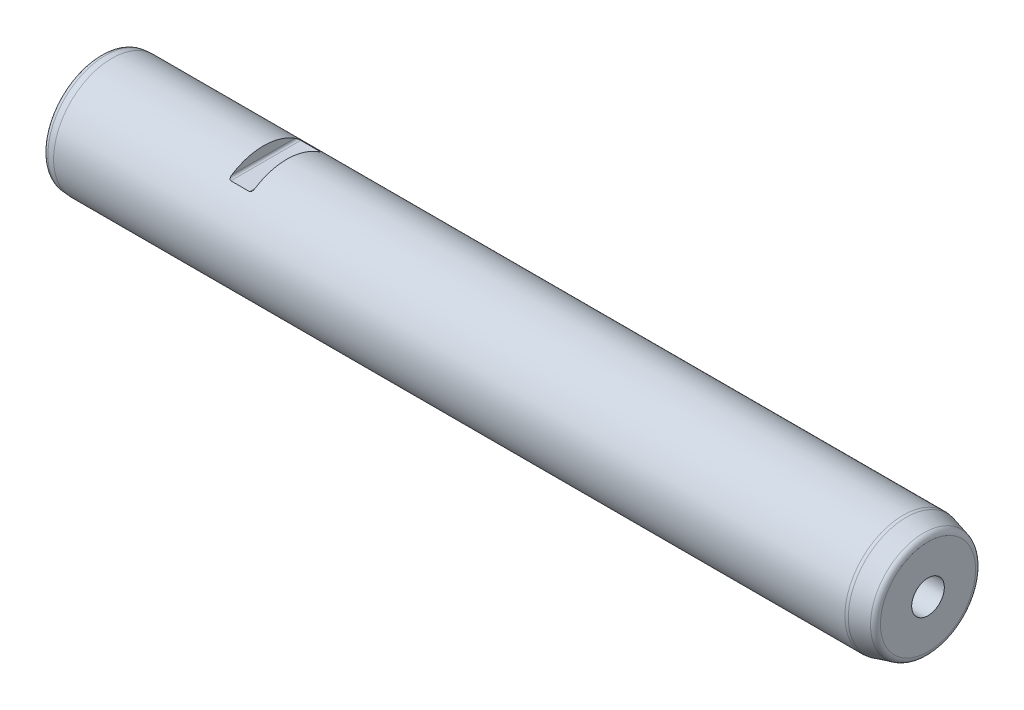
ISO-10303-21;
HEADER;
FILE_DESCRIPTION(('STEP AP214'),'2;1');
FILE_NAME('part.step','',(''),(''),'','','');
FILE_SCHEMA(('AUTOMOTIVE_DESIGN { 1 0 10303 214 1 1 1 1 }'));
ENDSEC;
DATA;
#1=APPLICATION_CONTEXT('core data for automotive mechanical design processes');
#2=APPLICATION_PROTOCOL_DEFINITION('international standard','automotive_design',2000,#1);
#3=PRODUCT_CONTEXT('',#1,'mechanical');
#4=PRODUCT('Part','Part','',(#3));
#5=PRODUCT_RELATED_PRODUCT_CATEGORY('part','',(#4));
#6=PRODUCT_DEFINITION_FORMATION('','',#4);
#7=PRODUCT_DEFINITION_CONTEXT('part definition',#1,'design');
#8=PRODUCT_DEFINITION('design','',#6,#7);
#9=PRODUCT_DEFINITION_SHAPE('','',#8);
#10=(LENGTH_UNIT() NAMED_UNIT(*) SI_UNIT(.MILLI.,.METRE.));
#11=(NAMED_UNIT(*) PLANE_ANGLE_UNIT() SI_UNIT($,.RADIAN.));
#12=(NAMED_UNIT(*) SI_UNIT($,.STERADIAN.) SOLID_ANGLE_UNIT());
#13=UNCERTAINTY_MEASURE_WITH_UNIT(LENGTH_MEASURE(1.E-05),#10,'distance_accuracy_value','');
#14=(GEOMETRIC_REPRESENTATION_CONTEXT(3) GLOBAL_UNCERTAINTY_ASSIGNED_CONTEXT((#13)) GLOBAL_UNIT_ASSIGNED_CONTEXT((#10,
#11,#12)) REPRESENTATION_CONTEXT('',''));
#15=CARTESIAN_POINT('',(0.,0.,0.));
#16=DIRECTION('',(0.,0.,1.));
#17=DIRECTION('',(1.,0.,0.));
#18=AXIS2_PLACEMENT_3D('',#15,#16,#17);
#19=CARTESIAN_POINT('',(0.,0.,0.));
#20=DIRECTION('',(1.,0.,0.));
#21=DIRECTION('',(0.,0.,-1.));
#22=AXIS2_PLACEMENT_3D('',#19,#20,#21);
#23=PLANE('',#22);
#24=CARTESIAN_POINT('',(0.,0.,0.));
#25=DIRECTION('',(1.,0.,0.));
#26=DIRECTION('',(0.,0.,-1.));
#27=AXIS2_PLACEMENT_3D('',#24,#25,#26);
#28=CIRCLE('',#27,22.2717287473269);
#29=CARTESIAN_POINT('',(0.,0.,-22.2717287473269));
#30=VERTEX_POINT('',#29);
#31=EDGE_CURVE('E160',#30,#30,#28,.F.);
#32=ORIENTED_EDGE('',*,*,#31,.T.);
#33=EDGE_LOOP('',(#32));
#34=FACE_BOUND('',#33,.T.);
#35=ADVANCED_FACE('F15',(#34),#23,.F.);
#36=CARTESIAN_POINT('',(0.,0.,0.));
#37=DIRECTION('',(-1.,0.,0.));
#38=DIRECTION('',(0.,0.,1.));
#39=AXIS2_PLACEMENT_3D('',#36,#37,#38);
#40=CYLINDRICAL_SURFACE('',#39,25.);
#41=CARTESIAN_POINT('',(79.,20.,-15.));
#42=CARTESIAN_POINT('',(79.0204326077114,19.9999962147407,-15.0000046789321));
#43=CARTESIAN_POINT('',(79.0408503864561,20.0006268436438,-14.99916423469));
#44=CARTESIAN_POINT('',(79.0814530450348,20.0031161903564,-14.9958444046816));
#45=CARTESIAN_POINT('',(79.1016381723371,20.0049734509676,-14.993366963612));
#46=CARTESIAN_POINT('',(79.1611193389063,20.0122659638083,-14.9836336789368));
#47=CARTESIAN_POINT('',(79.1998541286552,20.0194241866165,-14.9740740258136));
#48=CARTESIAN_POINT('',(79.274391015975,20.0376163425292,-14.9497209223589));
#49=CARTESIAN_POINT('',(79.3102051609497,20.048633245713,-14.9349504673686));
#50=CARTESIAN_POINT('',(79.3786965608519,20.0737580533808,-14.9011638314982));
#51=CARTESIAN_POINT('',(79.411363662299,20.0878755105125,-14.8821345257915));
#52=CARTESIAN_POINT('',(79.4896711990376,20.1264955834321,-14.8298921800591));
#53=CARTESIAN_POINT('',(79.5330744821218,20.1525500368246,-14.7944897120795));
#54=CARTESIAN_POINT('',(79.612543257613,20.2080720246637,-14.7185614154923));
#55=CARTESIAN_POINT('',(79.6485941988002,20.2375461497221,-14.6780256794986));
#56=CARTESIAN_POINT('',(79.707944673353,20.2928022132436,-14.6015056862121));
#57=CARTESIAN_POINT('',(79.7323659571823,20.3182250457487,-14.5661150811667));
#58=CARTESIAN_POINT('',(79.7773623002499,20.3700125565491,-14.4936048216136));
#59=CARTESIAN_POINT('',(79.7979348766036,20.3963778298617,-14.4564840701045));
#60=CARTESIAN_POINT('',(79.8545876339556,20.4765627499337,-14.3429056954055));
#61=CARTESIAN_POINT('',(79.8854357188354,20.5313064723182,-14.2644598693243));
#62=CARTESIAN_POINT('',(79.9262160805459,20.6210933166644,-14.1341533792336));
#63=CARTESIAN_POINT('',(79.939665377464,20.655945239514,-14.0831742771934));
#64=CARTESIAN_POINT('',(79.9623501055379,20.7257206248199,-13.9802847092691));
#65=CARTESIAN_POINT('',(79.9715835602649,20.7606441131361,-13.9283738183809));
#66=CARTESIAN_POINT('',(79.986039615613,20.829829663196,-13.8246889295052));
#67=CARTESIAN_POINT('',(79.9913190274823,20.8640939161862,-13.7729240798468));
#68=CARTESIAN_POINT('',(79.9982907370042,20.9323059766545,-13.6690320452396));
#69=CARTESIAN_POINT('',(79.9999872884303,20.9662541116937,-13.6169053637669));
#70=CARTESIAN_POINT('',(80.,21.,-13.5646599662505));
#71=B_SPLINE_CURVE_WITH_KNOTS('',3,(#41,#42,#43,#44,#45,#46,#47,#48,#49,#50,#51,#52,#53,#54,#55,
#56,#57,#58,#59,#60,#61,#62,#63,#64,#65,#66,#67,#68,#69,#70),.UNSPECIFIED.,.F.,.F.,(4,2,2,2,2,2,
2,2,2,2,2,2,2,2,4),(0.,0.0612433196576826,0.122414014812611,0.243243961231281,0.363547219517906,
0.484226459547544,0.668512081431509,0.853158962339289,1.00280656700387,1.15255038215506,
1.45300909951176,1.64250050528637,1.83208065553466,2.01888173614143,2.20546091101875),.UNSPECIFIED.);
#72=CARTESIAN_POINT('',(79.,20.,-15.));
#73=VERTEX_POINT('',#72);
#74=CARTESIAN_POINT('',(80.,21.,-13.5646599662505));
#75=VERTEX_POINT('',#74);
#76=EDGE_CURVE('E206',#73,#75,#71,.T.);
#77=ORIENTED_EDGE('',*,*,#76,.T.);
#78=CARTESIAN_POINT('',(80.,0.,0.));
#79=DIRECTION('',(1.,0.,0.));
#80=DIRECTION('',(0.,0.,-1.));
#81=AXIS2_PLACEMENT_3D('',#78,#79,#80);
#82=CIRCLE('',#81,25.);
#83=CARTESIAN_POINT('',(80.,21.,13.5646599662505));
#84=VERTEX_POINT('',#83);
#85=EDGE_CURVE('E9',#75,#84,#82,.T.);
#86=ORIENTED_EDGE('',*,*,#85,.T.);
#87=CARTESIAN_POINT('',(80.,21.,13.5646599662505));
#88=CARTESIAN_POINT('',(79.999955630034,20.9542327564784,13.6355224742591));
#89=CARTESIAN_POINT('',(79.9968527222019,20.9080699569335,13.7061939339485));
#90=CARTESIAN_POINT('',(79.9838958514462,20.8150990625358,13.846975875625));
#91=CARTESIAN_POINT('',(79.9740089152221,20.7682889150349,13.9170819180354));
#92=CARTESIAN_POINT('',(79.9467162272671,20.674203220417,14.056474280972));
#93=CARTESIAN_POINT('',(79.929243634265,20.6269272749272,14.1257475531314));
#94=CARTESIAN_POINT('',(79.8857890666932,20.5330392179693,14.2618757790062));
#95=CARTESIAN_POINT('',(79.8598269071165,20.4864258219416,14.3287359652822));
#96=CARTESIAN_POINT('',(79.8073455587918,20.4086672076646,14.4391617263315));
#97=CARTESIAN_POINT('',(79.78337733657,20.3771135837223,14.4836486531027));
#98=CARTESIAN_POINT('',(79.7299895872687,20.3153235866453,14.5701902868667));
#99=CARTESIAN_POINT('',(79.7005747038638,20.2850861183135,14.6122470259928));
#100=CARTESIAN_POINT('',(79.6352592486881,20.2264422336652,14.6933167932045));
#101=CARTESIAN_POINT('',(79.5993032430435,20.1980545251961,14.7322993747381));
#102=CARTESIAN_POINT('',(79.5203001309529,20.1446922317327,14.8051816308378));
#103=CARTESIAN_POINT('',(79.4772638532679,20.1197125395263,14.8390889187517));
#104=CARTESIAN_POINT('',(79.399061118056,20.0824152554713,14.8895010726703));
#105=CARTESIAN_POINT('',(79.365934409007,20.0686302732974,14.908068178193));
#106=CARTESIAN_POINT('',(79.296557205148,20.0442807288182,14.9407906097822));
#107=CARTESIAN_POINT('',(79.2603170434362,20.0337060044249,14.9549598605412));
#108=CARTESIAN_POINT('',(79.1874516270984,20.0170610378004,14.9772311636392));
#109=CARTESIAN_POINT('',(79.150978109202,20.0107598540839,14.9856445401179));
#110=CARTESIAN_POINT('',(79.0951306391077,20.0043553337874,14.9941915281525));
#111=CARTESIAN_POINT('',(79.0762205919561,20.0027279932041,14.9963621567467));
#112=CARTESIAN_POINT('',(79.0382110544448,20.0005483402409,14.999268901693));
#113=CARTESIAN_POINT('',(79.0191113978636,19.9999970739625,15.0000036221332));
#114=CARTESIAN_POINT('',(79.,20.,15.));
#115=B_SPLINE_CURVE_WITH_KNOTS('',3,(#87,#88,#89,#90,#91,#92,#93,#94,#95,#96,#97,#98,#99,#100,
#101,#102,#103,#104,#105,#106,#107,#108,#109,#110,#111,#112,#113,#114),.UNSPECIFIED.,.F.,.F.,(4,
2,2,2,2,2,2,2,2,2,2,2,2,4),(0.,0.25309909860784,0.507437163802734,0.764063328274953,
1.02009474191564,1.19857022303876,1.37689423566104,1.55680656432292,1.7364462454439,
1.85724328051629,1.9776538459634,2.09088655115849,2.14812113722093,2.20541133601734),.UNSPECIFIED.);
#116=CARTESIAN_POINT('',(79.,20.,15.));
#117=VERTEX_POINT('',#116);
#118=EDGE_CURVE('E23',#84,#117,#115,.T.);
#119=ORIENTED_EDGE('',*,*,#118,.T.);
#120=DIRECTION('',(-1.,0.,0.));
#121=VECTOR('',#120,1.);
#122=CARTESIAN_POINT('',(0.,20.,15.));
#123=LINE('',#122,#121);
#124=CARTESIAN_POINT('',(71.,20.,15.));
#125=VERTEX_POINT('',#124);
#126=EDGE_CURVE('E74',#117,#125,#123,.T.);
#127=ORIENTED_EDGE('',*,*,#126,.T.);
#128=CARTESIAN_POINT('',(71.,20.,15.));
#129=CARTESIAN_POINT('',(70.9795673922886,19.9999962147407,15.0000046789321));
#130=CARTESIAN_POINT('',(70.9591496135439,20.0006268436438,14.99916423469));
#131=CARTESIAN_POINT('',(70.9185469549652,20.0031161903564,14.9958444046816));
#132=CARTESIAN_POINT('',(70.8983618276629,20.0049734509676,14.993366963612));
#133=CARTESIAN_POINT('',(70.8388806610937,20.0122659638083,14.9836336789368));
#134=CARTESIAN_POINT('',(70.8001458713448,20.0194241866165,14.9740740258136));
#135=CARTESIAN_POINT('',(70.725608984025,20.0376163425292,14.9497209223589));
#136=CARTESIAN_POINT('',(70.6897948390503,20.048633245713,14.9349504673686));
#137=CARTESIAN_POINT('',(70.6213034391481,20.0737580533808,14.9011638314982));
#138=CARTESIAN_POINT('',(70.5886363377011,20.0878755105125,14.8821345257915));
#139=CARTESIAN_POINT('',(70.5103288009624,20.1264955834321,14.8298921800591));
#140=CARTESIAN_POINT('',(70.4669255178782,20.1525500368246,14.7944897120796));
#141=CARTESIAN_POINT('',(70.3874567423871,20.2080720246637,14.7185614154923));
#142=CARTESIAN_POINT('',(70.3514058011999,20.2375461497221,14.6780256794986));
#143=CARTESIAN_POINT('',(70.292055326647,20.2928022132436,14.6015056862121));
#144=CARTESIAN_POINT('',(70.2676340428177,20.3182250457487,14.5661150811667));
#145=CARTESIAN_POINT('',(70.2226376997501,20.3700125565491,14.4936048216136));
#146=CARTESIAN_POINT('',(70.2020651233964,20.3963778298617,14.4564840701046));
#147=CARTESIAN_POINT('',(70.1454123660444,20.4765627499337,14.3429056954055));
#148=CARTESIAN_POINT('',(70.1145642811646,20.5313064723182,14.2644598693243));
#149=CARTESIAN_POINT('',(70.0737839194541,20.6210933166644,14.1341533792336));
#150=CARTESIAN_POINT('',(70.060334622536,20.655945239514,14.0831742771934));
#151=CARTESIAN_POINT('',(70.0376498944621,20.7257206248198,13.9802847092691));
#152=CARTESIAN_POINT('',(70.0284164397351,20.760644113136,13.9283738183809));
#153=CARTESIAN_POINT('',(70.013960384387,20.829829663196,13.8246889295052));
#154=CARTESIAN_POINT('',(70.0086809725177,20.8640939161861,13.7729240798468));
#155=CARTESIAN_POINT('',(70.0017092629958,20.9323059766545,13.6690320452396));
#156=CARTESIAN_POINT('',(70.0000127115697,20.9662541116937,13.6169053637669));
#157=CARTESIAN_POINT('',(70.,21.,13.5646599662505));
#158=B_SPLINE_CURVE_WITH_KNOTS('',3,(#128,#129,#130,#131,#132,#133,#134,#135,#136,#137,#138,
#139,#140,#141,#142,#143,#144,#145,#146,#147,#148,#149,#150,#151,#152,#153,#154,#155,#156,#157),
.UNSPECIFIED.,.F.,.F.,(4,2,2,2,2,2,2,2,2,2,2,2,2,2,4),(0.,0.0612433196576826,0.122414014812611,
0.243243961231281,0.363547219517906,0.484226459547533,0.668512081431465,0.853158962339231,
1.00280656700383,1.15255038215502,1.45300909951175,1.64250050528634,1.83208065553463,
2.01888173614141,2.20546091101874),.UNSPECIFIED.);
#159=CARTESIAN_POINT('',(70.,21.,13.5646599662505));
#160=VERTEX_POINT('',#159);
#161=EDGE_CURVE('E65',#125,#160,#158,.T.);
#162=ORIENTED_EDGE('',*,*,#161,.T.);
#163=CARTESIAN_POINT('',(70.,0.,0.));
#164=DIRECTION('',(-1.,0.,0.));
#165=DIRECTION('',(0.,-1.,0.));
#166=AXIS2_PLACEMENT_3D('',#163,#164,#165);
#167=CIRCLE('',#166,25.);
#168=CARTESIAN_POINT('',(70.,21.,-13.5646599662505));
#169=VERTEX_POINT('',#168);
#170=EDGE_CURVE('E54',#160,#169,#167,.T.);
#171=ORIENTED_EDGE('',*,*,#170,.T.);
#172=CARTESIAN_POINT('',(70.,21.,-13.5646599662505));
#173=CARTESIAN_POINT('',(70.000044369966,20.9542327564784,-13.6355224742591));
#174=CARTESIAN_POINT('',(70.0031472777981,20.9080699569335,-13.7061939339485));
#175=CARTESIAN_POINT('',(70.0161041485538,20.8150990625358,-13.846975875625));
#176=CARTESIAN_POINT('',(70.0259910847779,20.7682889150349,-13.9170819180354));
#177=CARTESIAN_POINT('',(70.0532837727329,20.674203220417,-14.0564742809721));
#178=CARTESIAN_POINT('',(70.070756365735,20.6269272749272,-14.1257475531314));
#179=CARTESIAN_POINT('',(70.1142109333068,20.5330392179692,-14.2618757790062));
#180=CARTESIAN_POINT('',(70.1401730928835,20.4864258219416,-14.3287359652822));
#181=CARTESIAN_POINT('',(70.1926544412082,20.4086672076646,-14.4391617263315));
#182=CARTESIAN_POINT('',(70.21662266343,20.3771135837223,-14.4836486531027));
#183=CARTESIAN_POINT('',(70.2700104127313,20.3153235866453,-14.5701902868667));
#184=CARTESIAN_POINT('',(70.2994252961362,20.2850861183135,-14.6122470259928));
#185=CARTESIAN_POINT('',(70.3647407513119,20.2264422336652,-14.6933167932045));
#186=CARTESIAN_POINT('',(70.4006967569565,20.1980545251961,-14.7322993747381));
#187=CARTESIAN_POINT('',(70.4796998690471,20.1446922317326,-14.8051816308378));
#188=CARTESIAN_POINT('',(70.5227361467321,20.1197125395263,-14.8390889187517));
#189=CARTESIAN_POINT('',(70.600938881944,20.0824152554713,-14.8895010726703));
#190=CARTESIAN_POINT('',(70.634065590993,20.0686302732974,-14.9080681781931));
#191=CARTESIAN_POINT('',(70.7034427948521,20.0442807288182,-14.9407906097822));
#192=CARTESIAN_POINT('',(70.7396829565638,20.0337060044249,-14.9549598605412));
#193=CARTESIAN_POINT('',(70.8125483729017,20.0170610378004,-14.9772311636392));
#194=CARTESIAN_POINT('',(70.849021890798,20.0107598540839,-14.9856445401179));
#195=CARTESIAN_POINT('',(70.9048693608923,20.0043553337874,-14.9941915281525));
#196=CARTESIAN_POINT('',(70.9237794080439,20.0027279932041,-14.9963621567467));
#197=CARTESIAN_POINT('',(70.9617889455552,20.0005483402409,-14.999268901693));
#198=CARTESIAN_POINT('',(70.9808886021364,19.9999970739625,-15.0000036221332));
#199=CARTESIAN_POINT('',(71.,20.,-15.));
#200=B_SPLINE_CURVE_WITH_KNOTS('',3,(#172,#173,#174,#175,#176,#177,#178,#179,#180,#181,#182,
#183,#184,#185,#186,#187,#188,#189,#190,#191,#192,#193,#194,#195,#196,#197,#198,#199),
.UNSPECIFIED.,.F.,.F.,(4,2,2,2,2,2,2,2,2,2,2,2,2,4),(0.,0.253099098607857,0.507437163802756,
0.764063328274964,1.02009474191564,1.19857022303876,1.37689423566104,1.55680656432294,
1.7364462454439,1.85724328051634,1.97765384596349,2.09088655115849,2.14812113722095,
2.20541133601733),.UNSPECIFIED.);
#201=CARTESIAN_POINT('',(71.,20.,-15.));
#202=VERTEX_POINT('',#201);
#203=EDGE_CURVE('E59',#169,#202,#200,.T.);
#204=ORIENTED_EDGE('',*,*,#203,.T.);
#205=DIRECTION('',(-1.,0.,0.));
#206=VECTOR('',#205,1.);
#207=CARTESIAN_POINT('',(0.,20.,-15.));
#208=LINE('',#207,#206);
#209=EDGE_CURVE('E75',#202,#73,#208,.F.);
#210=ORIENTED_EDGE('',*,*,#209,.T.);
#211=EDGE_LOOP('',(#77,#86,#119,#127,#162,#171,#204,#210));
#212=FACE_BOUND('',#211,.T.);
#213=CARTESIAN_POINT('',(4.99999999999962,0.,0.));
#214=DIRECTION('',(1.,0.,0.));
#215=DIRECTION('',(0.,0.,-1.));
#216=AXIS2_PLACEMENT_3D('',#213,#214,#215);
#217=CIRCLE('',#216,25.);
#218=CARTESIAN_POINT('',(4.99999999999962,0.,-25.));
#219=VERTEX_POINT('',#218);
#220=EDGE_CURVE('E159',#219,#219,#217,.T.);
#221=ORIENTED_EDGE('',*,*,#220,.T.);
#222=EDGE_LOOP('',(#221));
#223=FACE_BOUND('',#222,.T.);
#224=CARTESIAN_POINT('',(344.341737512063,0.,0.));
#225=DIRECTION('',(1.,0.,0.));
#226=DIRECTION('',(0.,0.,-1.));
#227=AXIS2_PLACEMENT_3D('',#224,#225,#226);
#228=CIRCLE('',#227,25.);
#229=CARTESIAN_POINT('',(344.341737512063,0.,-25.));
#230=VERTEX_POINT('',#229);
#231=EDGE_CURVE('E177',#230,#230,#228,.F.);
#232=ORIENTED_EDGE('',*,*,#231,.T.);
#233=EDGE_LOOP('',(#232));
#234=FACE_BOUND('',#233,.T.);
#235=ADVANCED_FACE('F71',(#212,#223,#234),#40,.T.);
#236=CARTESIAN_POINT('',(355.,0.,0.));
#237=DIRECTION('',(-1.,0.,0.));
#238=DIRECTION('',(0.,0.,1.));
#239=AXIS2_PLACEMENT_3D('',#236,#237,#238);
#240=CONICAL_SURFACE('',#239,22.3205080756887,0.26179938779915);
#241=CARTESIAN_POINT('',(353.147047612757,0.,0.));
#242=DIRECTION('',(1.,0.,0.));
#243=DIRECTION('',(0.,0.,-1.));
#244=AXIS2_PLACEMENT_3D('',#241,#242,#243);
#245=CIRCLE('',#244,22.817005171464);
#246=CARTESIAN_POINT('',(353.147047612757,0.,-22.817005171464));
#247=VERTEX_POINT('',#246);
#248=EDGE_CURVE('E165',#247,#247,#245,.F.);
#249=ORIENTED_EDGE('',*,*,#248,.T.);
#250=EDGE_LOOP('',(#249));
#251=FACE_BOUND('',#250,.T.);
#252=CARTESIAN_POINT('',(345.635832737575,0.,0.));
#253=DIRECTION('',(1.,0.,0.));
#254=DIRECTION('',(0.,0.,-1.));
#255=AXIS2_PLACEMENT_3D('',#252,#253,#254);
#256=CIRCLE('',#255,24.8296291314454);
#257=CARTESIAN_POINT('',(345.635832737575,0.,-24.8296291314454));
#258=VERTEX_POINT('',#257);
#259=EDGE_CURVE('E190',#258,#258,#256,.T.);
#260=ORIENTED_EDGE('',*,*,#259,.T.);
#261=EDGE_LOOP('',(#260));
#262=FACE_BOUND('',#261,.T.);
#263=ADVANCED_FACE('F122',(#251,#262),#240,.T.);
#264=CARTESIAN_POINT('',(355.,22.3205080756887,0.));
#265=DIRECTION('',(-1.,0.,0.));
#266=DIRECTION('',(0.,0.,1.));
#267=AXIS2_PLACEMENT_3D('',#264,#265,#266);
#268=PLANE('',#267);
#269=CARTESIAN_POINT('',(355.,0.,0.));
#270=DIRECTION('',(1.,0.,0.));
#271=DIRECTION('',(0.,0.,-1.));
#272=AXIS2_PLACEMENT_3D('',#269,#270,#271);
#273=CIRCLE('',#272,7.);
#274=CARTESIAN_POINT('',(355.,0.,-7.));
#275=VERTEX_POINT('',#274);
#276=EDGE_CURVE('E180',#275,#275,#273,.T.);
#277=ORIENTED_EDGE('',*,*,#276,.F.);
#278=EDGE_LOOP('',(#277));
#279=FACE_BOUND('',#278,.T.);
#280=CARTESIAN_POINT('',(355.,0.,0.));
#281=DIRECTION('',(-1.,0.,0.));
#282=DIRECTION('',(0.,0.,1.));
#283=AXIS2_PLACEMENT_3D('',#280,#281,#282);
#284=CIRCLE('',#283,20.4021906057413);
#285=CARTESIAN_POINT('',(355.,0.,20.4021906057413));
#286=VERTEX_POINT('',#285);
#287=EDGE_CURVE('E161',#286,#286,#284,.F.);
#288=ORIENTED_EDGE('',*,*,#287,.T.);
#289=EDGE_LOOP('',(#288));
#290=FACE_BOUND('',#289,.T.);
#291=ADVANCED_FACE('F119',(#279,#290),#268,.F.);
#292=CARTESIAN_POINT('',(344.341737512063,0.,0.));
#293=DIRECTION('',(1.,0.,0.));
#294=DIRECTION('',(0.,0.,-1.));
#295=AXIS2_PLACEMENT_3D('',#292,#293,#294);
#296=TOROIDAL_SURFACE('',#295,20.,5.);
#297=ORIENTED_EDGE('',*,*,#259,.F.);
#298=EDGE_LOOP('',(#297));
#299=FACE_BOUND('',#298,.T.);
#300=ORIENTED_EDGE('',*,*,#231,.F.);
#301=EDGE_LOOP('',(#300));
#302=FACE_BOUND('',#301,.T.);
#303=ADVANCED_FACE('F121',(#299,#302),#296,.T.);
#304=CARTESIAN_POINT('',(352.5,0.,0.));
#305=DIRECTION('',(-1.,0.,0.));
#306=DIRECTION('',(0.,0.,1.));
#307=AXIS2_PLACEMENT_3D('',#304,#305,#306);
#308=TOROIDAL_SURFACE('',#307,20.4021906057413,2.5);
#309=ORIENTED_EDGE('',*,*,#287,.F.);
#310=EDGE_LOOP('',(#309));
#311=FACE_BOUND('',#310,.T.);
#312=ORIENTED_EDGE('',*,*,#248,.F.);
#313=EDGE_LOOP('',(#312));
#314=FACE_BOUND('',#313,.T.);
#315=ADVANCED_FACE('F142',(#311,#314),#308,.T.);
#316=CARTESIAN_POINT('',(0.,0.,0.));
#317=DIRECTION('',(1.,0.,0.));
#318=DIRECTION('',(0.,0.,-1.));
#319=AXIS2_PLACEMENT_3D('',#316,#317,#318);
#320=CONICAL_SURFACE('',#319,24.5625566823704,0.0872664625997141);
#321=CARTESIAN_POINT('',(2.28211064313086,0.,0.));
#322=DIRECTION('',(1.,0.,0.));
#323=DIRECTION('',(0.,0.,-1.));
#324=AXIS2_PLACEMENT_3D('',#321,#322,#323);
#325=CIRCLE('',#324,24.7622154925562);
#326=CARTESIAN_POINT('',(2.28211064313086,0.,-24.7622154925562));
#327=VERTEX_POINT('',#326);
#328=EDGE_CURVE('E60',#327,#327,#325,.T.);
#329=ORIENTED_EDGE('',*,*,#328,.T.);
#330=EDGE_LOOP('',(#329));
#331=FACE_BOUND('',#330,.T.);
#332=ORIENTED_EDGE('',*,*,#220,.F.);
#333=EDGE_LOOP('',(#332));
#334=FACE_BOUND('',#333,.T.);
#335=ADVANCED_FACE('F145',(#331,#334),#320,.T.);
#336=CARTESIAN_POINT('',(2.5,0.,0.));
#337=DIRECTION('',(1.,0.,0.));
#338=DIRECTION('',(0.,0.,-1.));
#339=AXIS2_PLACEMENT_3D('',#336,#337,#338);
#340=TOROIDAL_SURFACE('',#339,22.2717287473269,2.5);
#341=ORIENTED_EDGE('',*,*,#328,.F.);
#342=EDGE_LOOP('',(#341));
#343=FACE_BOUND('',#342,.T.);
#344=ORIENTED_EDGE('',*,*,#31,.F.);
#345=EDGE_LOOP('',(#344));
#346=FACE_BOUND('',#345,.T.);
#347=ADVANCED_FACE('F17',(#343,#346),#340,.T.);
#348=CARTESIAN_POINT('',(331.,0.,0.));
#349=DIRECTION('',(1.,0.,0.));
#350=DIRECTION('',(0.,0.,-1.));
#351=AXIS2_PLACEMENT_3D('',#348,#349,#350);
#352=PLANE('',#351);
#353=CARTESIAN_POINT('',(331.,0.,0.));
#354=DIRECTION('',(1.,0.,0.));
#355=DIRECTION('',(0.,0.,-1.));
#356=AXIS2_PLACEMENT_3D('',#353,#354,#355);
#357=CIRCLE('',#356,7.);
#358=CARTESIAN_POINT('',(331.,0.,-7.));
#359=VERTEX_POINT('',#358);
#360=EDGE_CURVE('E173',#359,#359,#357,.T.);
#361=ORIENTED_EDGE('',*,*,#360,.T.);
#362=EDGE_LOOP('',(#361));
#363=FACE_BOUND('',#362,.T.);
#364=CARTESIAN_POINT('',(331.,0.,0.));
#365=DIRECTION('',(1.,0.,0.));
#366=DIRECTION('',(0.,0.,-1.));
#367=AXIS2_PLACEMENT_3D('',#364,#365,#366);
#368=CIRCLE('',#367,5.1);
#369=CARTESIAN_POINT('',(331.,0.,-5.1));
#370=VERTEX_POINT('',#369);
#371=EDGE_CURVE('E170',#370,#370,#368,.F.);
#372=ORIENTED_EDGE('',*,*,#371,.T.);
#373=EDGE_LOOP('',(#372));
#374=FACE_BOUND('',#373,.T.);
#375=ADVANCED_FACE('F103',(#363,#374),#352,.T.);
#376=CARTESIAN_POINT('',(331.,0.,0.));
#377=DIRECTION('',(1.,0.,0.));
#378=DIRECTION('',(0.,0.,-1.));
#379=AXIS2_PLACEMENT_3D('',#376,#377,#378);
#380=CYLINDRICAL_SURFACE('',#379,7.);
#381=ORIENTED_EDGE('',*,*,#360,.F.);
#382=EDGE_LOOP('',(#381));
#383=FACE_BOUND('',#382,.T.);
#384=ORIENTED_EDGE('',*,*,#276,.T.);
#385=EDGE_LOOP('',(#384));
#386=FACE_BOUND('',#385,.T.);
#387=ADVANCED_FACE('F106',(#383,#386),#380,.F.);
#388=CARTESIAN_POINT('',(325.,0.,0.));
#389=DIRECTION('',(1.,0.,0.));
#390=DIRECTION('',(0.,0.,-1.));
#391=AXIS2_PLACEMENT_3D('',#388,#389,#390);
#392=CONICAL_SURFACE('',#391,5.1,1.0471975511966);
#393=CARTESIAN_POINT('',(322.055513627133,0.,0.));
#394=VERTEX_POINT('',#393);
#395=VERTEX_LOOP('',#394);
#396=FACE_BOUND('',#395,.T.);
#397=CARTESIAN_POINT('',(325.,0.,0.));
#398=DIRECTION('',(1.,0.,0.));
#399=DIRECTION('',(0.,0.,-1.));
#400=AXIS2_PLACEMENT_3D('',#397,#398,#399);
#401=CIRCLE('',#400,5.1);
#402=CARTESIAN_POINT('',(325.,0.,-5.1));
#403=VERTEX_POINT('',#402);
#404=EDGE_CURVE('E172',#403,#403,#401,.T.);
#405=ORIENTED_EDGE('',*,*,#404,.T.);
#406=EDGE_LOOP('',(#405));
#407=FACE_BOUND('',#406,.T.);
#408=ADVANCED_FACE('F110',(#396,#407),#392,.F.);
#409=CARTESIAN_POINT('',(355.,0.,0.));
#410=DIRECTION('',(1.,0.,0.));
#411=DIRECTION('',(0.,0.,-1.));
#412=AXIS2_PLACEMENT_3D('',#409,#410,#411);
#413=CYLINDRICAL_SURFACE('',#412,5.1);
#414=ORIENTED_EDGE('',*,*,#404,.F.);
#415=EDGE_LOOP('',(#414));
#416=FACE_BOUND('',#415,.T.);
#417=ORIENTED_EDGE('',*,*,#371,.F.);
#418=EDGE_LOOP('',(#417));
#419=FACE_BOUND('',#418,.T.);
#420=ADVANCED_FACE('F112',(#416,#419),#413,.F.);
#421=CARTESIAN_POINT('',(80.,21.,-25.));
#422=DIRECTION('',(1.,0.,0.));
#423=DIRECTION('',(0.,0.,-1.));
#424=AXIS2_PLACEMENT_3D('',#421,#422,#423);
#425=PLANE('',#424);
#426=DIRECTION('',(0.,0.,1.));
#427=VECTOR('',#426,1.);
#428=CARTESIAN_POINT('',(80.,21.,-25.));
#429=LINE('',#428,#427);
#430=EDGE_CURVE('E184',#75,#84,#429,.T.);
#431=ORIENTED_EDGE('',*,*,#430,.T.);
#432=ORIENTED_EDGE('',*,*,#85,.F.);
#433=EDGE_LOOP('',(#431,#432));
#434=FACE_BOUND('',#433,.T.);
#435=ADVANCED_FACE('F115',(#434),#425,.F.);
#436=CARTESIAN_POINT('',(79.,21.,-25.));
#437=DIRECTION('',(0.,0.,1.));
#438=DIRECTION('',(1.,0.,0.));
#439=AXIS2_PLACEMENT_3D('',#436,#437,#438);
#440=CYLINDRICAL_SURFACE('',#439,1.);
#441=ORIENTED_EDGE('',*,*,#430,.F.);
#442=ORIENTED_EDGE('',*,*,#76,.F.);
#443=DIRECTION('',(0.,0.,1.));
#444=VECTOR('',#443,1.);
#445=CARTESIAN_POINT('',(79.,20.,-25.));
#446=LINE('',#445,#444);
#447=EDGE_CURVE('E199',#73,#117,#446,.T.);
#448=ORIENTED_EDGE('',*,*,#447,.T.);
#449=ORIENTED_EDGE('',*,*,#118,.F.);
#450=EDGE_LOOP('',(#441,#442,#448,#449));
#451=FACE_BOUND('',#450,.T.);
#452=ADVANCED_FACE('F217',(#451),#440,.F.);
#453=CARTESIAN_POINT('',(71.,20.,-25.));
#454=DIRECTION('',(0.,-1.,0.));
#455=DIRECTION('',(0.,0.,-1.));
#456=AXIS2_PLACEMENT_3D('',#453,#454,#455);
#457=PLANE('',#456);
#458=ORIENTED_EDGE('',*,*,#447,.F.);
#459=ORIENTED_EDGE('',*,*,#209,.F.);
#460=DIRECTION('',(0.,0.,1.));
#461=VECTOR('',#460,1.);
#462=CARTESIAN_POINT('',(71.,20.,-25.));
#463=LINE('',#462,#461);
#464=EDGE_CURVE('E67',#202,#125,#463,.T.);
#465=ORIENTED_EDGE('',*,*,#464,.T.);
#466=ORIENTED_EDGE('',*,*,#126,.F.);
#467=EDGE_LOOP('',(#458,#459,#465,#466));
#468=FACE_BOUND('',#467,.T.);
#469=ADVANCED_FACE('F98',(#468),#457,.F.);
#470=CARTESIAN_POINT('',(71.,21.,-25.));
#471=DIRECTION('',(0.,0.,1.));
#472=DIRECTION('',(1.,0.,0.));
#473=AXIS2_PLACEMENT_3D('',#470,#471,#472);
#474=CYLINDRICAL_SURFACE('',#473,1.);
#475=ORIENTED_EDGE('',*,*,#464,.F.);
#476=ORIENTED_EDGE('',*,*,#203,.F.);
#477=DIRECTION('',(0.,0.,1.));
#478=VECTOR('',#477,1.);
#479=CARTESIAN_POINT('',(70.,21.,-25.));
#480=LINE('',#479,#478);
#481=EDGE_CURVE('E29',#169,#160,#480,.T.);
#482=ORIENTED_EDGE('',*,*,#481,.T.);
#483=ORIENTED_EDGE('',*,*,#161,.F.);
#484=EDGE_LOOP('',(#475,#476,#482,#483));
#485=FACE_BOUND('',#484,.T.);
#486=ADVANCED_FACE('F64',(#485),#474,.F.);
#487=CARTESIAN_POINT('',(70.,25.,-25.));
#488=DIRECTION('',(-1.,0.,0.));
#489=DIRECTION('',(0.,-1.,0.));
#490=AXIS2_PLACEMENT_3D('',#487,#488,#489);
#491=PLANE('',#490);
#492=ORIENTED_EDGE('',*,*,#481,.F.);
#493=ORIENTED_EDGE('',*,*,#170,.F.);
#494=EDGE_LOOP('',(#492,#493));
#495=FACE_BOUND('',#494,.T.);
#496=ADVANCED_FACE('F55',(#495),#491,.F.);
#497=CLOSED_SHELL('',(#35,#235,#263,#291,#303,#315,#335,#347,#375,#387,#408,#420,#435,#452,#469,
#486,#496));
#498=MANIFOLD_SOLID_BREP('B1',#497);
#499=ADVANCED_BREP_SHAPE_REPRESENTATION('',(#18,#498),#14);
#500=SHAPE_DEFINITION_REPRESENTATION(#9,#499);
ENDSEC;
END-ISO-10303-21;
